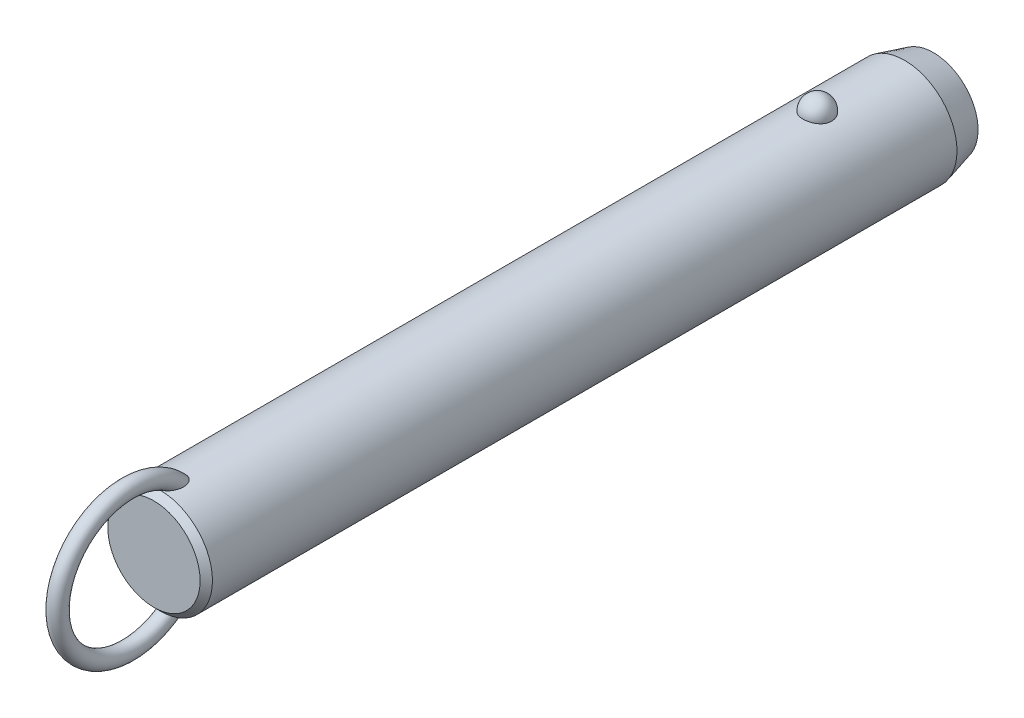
ISO-10303-21;
HEADER;
FILE_DESCRIPTION(('STEP AP214'),'2;1');
FILE_NAME('part.step','',(''),(''),'','','');
FILE_SCHEMA(('AUTOMOTIVE_DESIGN { 1 0 10303 214 1 1 1 1 }'));
ENDSEC;
DATA;
#1=APPLICATION_CONTEXT('core data for automotive mechanical design processes');
#2=APPLICATION_PROTOCOL_DEFINITION('international standard','automotive_design',2000,#1);
#3=PRODUCT_CONTEXT('',#1,'mechanical');
#4=PRODUCT('Part','Part','',(#3));
#5=PRODUCT_RELATED_PRODUCT_CATEGORY('part','',(#4));
#6=PRODUCT_DEFINITION_FORMATION('','',#4);
#7=PRODUCT_DEFINITION_CONTEXT('part definition',#1,'design');
#8=PRODUCT_DEFINITION('design','',#6,#7);
#9=PRODUCT_DEFINITION_SHAPE('','',#8);
#10=(LENGTH_UNIT() NAMED_UNIT(*) SI_UNIT(.MILLI.,.METRE.));
#11=(NAMED_UNIT(*) PLANE_ANGLE_UNIT() SI_UNIT($,.RADIAN.));
#12=(NAMED_UNIT(*) SI_UNIT($,.STERADIAN.) SOLID_ANGLE_UNIT());
#13=UNCERTAINTY_MEASURE_WITH_UNIT(LENGTH_MEASURE(1.E-05),#10,'distance_accuracy_value','');
#14=(GEOMETRIC_REPRESENTATION_CONTEXT(3) GLOBAL_UNCERTAINTY_ASSIGNED_CONTEXT((#13)) GLOBAL_UNIT_ASSIGNED_CONTEXT((#10,
#11,#12)) REPRESENTATION_CONTEXT('',''));
#15=CARTESIAN_POINT('',(0.,0.,0.));
#16=DIRECTION('',(0.,0.,1.));
#17=DIRECTION('',(1.,0.,0.));
#18=AXIS2_PLACEMENT_3D('',#15,#16,#17);
#19=CARTESIAN_POINT('',(0.,0.,144.8));
#20=DIRECTION('',(0.,0.,-1.));
#21=DIRECTION('',(-1.,0.,0.));
#22=AXIS2_PLACEMENT_3D('',#19,#20,#21);
#23=CYLINDRICAL_SURFACE('',#22,12.7);
#24=CARTESIAN_POINT('',(3.46661256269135,12.2177165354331,-3.5));
#25=CARTESIAN_POINT('',(3.4666090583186,12.2177194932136,-3.30432790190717));
#26=CARTESIAN_POINT('',(3.45063567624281,12.2222841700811,-3.10861112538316));
#27=CARTESIAN_POINT('',(3.38712451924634,12.2400345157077,-2.72271899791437));
#28=CARTESIAN_POINT('',(3.33957415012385,12.2532236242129,-2.53254588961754));
#29=CARTESIAN_POINT('',(3.2141234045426,12.286724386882,-2.16324948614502));
#30=CARTESIAN_POINT('',(3.13623639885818,12.3070329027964,-1.98412136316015));
#31=CARTESIAN_POINT('',(2.95205930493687,12.3525018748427,-1.64180592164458));
#32=CARTESIAN_POINT('',(2.84577003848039,12.3776621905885,-1.47861814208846));
#33=CARTESIAN_POINT('',(2.60688050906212,12.4301712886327,-1.17190583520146));
#34=CARTESIAN_POINT('',(2.47415697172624,12.4575299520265,-1.02847897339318));
#35=CARTESIAN_POINT('',(2.18615174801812,12.5112810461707,-0.766177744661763));
#36=CARTESIAN_POINT('',(2.03087002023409,12.5376734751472,-0.64730342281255));
#37=CARTESIAN_POINT('',(1.70237334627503,12.5864761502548,-0.437732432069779));
#38=CARTESIAN_POINT('',(1.52920948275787,12.6088972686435,-0.346958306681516));
#39=CARTESIAN_POINT('',(1.16944170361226,12.6473352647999,-0.195750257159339));
#40=CARTESIAN_POINT('',(0.982839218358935,12.663352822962,-0.135313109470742));
#41=CARTESIAN_POINT('',(0.604961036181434,12.6869706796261,-0.0473241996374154));
#42=CARTESIAN_POINT('',(0.413823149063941,12.6947125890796,-0.0192185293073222));
#43=CARTESIAN_POINT('',(0.0293827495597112,12.7014203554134,0.00517254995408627));
#44=CARTESIAN_POINT('',(-0.163919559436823,12.7003870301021,0.00146092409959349));
#45=CARTESIAN_POINT('',(-0.544374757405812,12.689735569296,-0.0373939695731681));
#46=CARTESIAN_POINT('',(-0.731575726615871,12.6802364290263,-0.0721015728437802));
#47=CARTESIAN_POINT('',(-1.09733277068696,12.6538333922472,-0.171364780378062));
#48=CARTESIAN_POINT('',(-1.27588869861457,12.6369293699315,-0.235920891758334));
#49=CARTESIAN_POINT('',(-1.6204698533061,12.5973946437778,-0.393548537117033));
#50=CARTESIAN_POINT('',(-1.78641865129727,12.5747321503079,-0.486778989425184));
#51=CARTESIAN_POINT('',(-2.10030671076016,12.5261316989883,-0.699110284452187));
#52=CARTESIAN_POINT('',(-2.24824419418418,12.5001934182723,-0.818213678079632));
#53=CARTESIAN_POINT('',(-2.52491489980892,12.4472906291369,-1.08157124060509));
#54=CARTESIAN_POINT('',(-2.65324222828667,12.4203160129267,-1.22624992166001));
#55=CARTESIAN_POINT('',(-2.88410007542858,12.3687509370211,-1.53528325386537));
#56=CARTESIAN_POINT('',(-2.98662883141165,12.3441606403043,-1.69963924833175));
#57=CARTESIAN_POINT('',(-3.16432417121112,12.2998199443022,-2.04548497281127));
#58=CARTESIAN_POINT('',(-3.23917525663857,12.2801261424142,-2.22714424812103));
#59=CARTESIAN_POINT('',(-3.35800573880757,12.248167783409,-2.6009138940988));
#60=CARTESIAN_POINT('',(-3.4019860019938,12.2359030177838,-2.79302397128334));
#61=CARTESIAN_POINT('',(-3.45784812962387,12.2202347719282,-3.18140279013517));
#62=CARTESIAN_POINT('',(-3.46986123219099,12.2167950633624,-3.37765118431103));
#63=CARTESIAN_POINT('',(-3.46186273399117,12.2190638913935,-3.76943689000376));
#64=CARTESIAN_POINT('',(-3.44185196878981,12.2247721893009,-3.96497421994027));
#65=CARTESIAN_POINT('',(-3.37048652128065,12.2446381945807,-4.34881728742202));
#66=CARTESIAN_POINT('',(-3.31928253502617,12.2587552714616,-4.53715319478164));
#67=CARTESIAN_POINT('',(-3.18693461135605,12.2938237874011,-4.90231727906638));
#68=CARTESIAN_POINT('',(-3.1057895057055,12.3147754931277,-5.07914500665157));
#69=CARTESIAN_POINT('',(-2.91506431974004,12.3613125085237,-5.41732059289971));
#70=CARTESIAN_POINT('',(-2.80533587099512,12.3869217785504,-5.57858147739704));
#71=CARTESIAN_POINT('',(-2.560414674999,12.4398525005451,-5.88013283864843));
#72=CARTESIAN_POINT('',(-2.42522099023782,12.4671740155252,-6.02042254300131));
#73=CARTESIAN_POINT('',(-2.1323357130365,12.5205965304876,-6.27662798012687));
#74=CARTESIAN_POINT('',(-1.97456596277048,12.5466928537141,-6.3924554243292));
#75=CARTESIAN_POINT('',(-1.64115839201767,12.5946384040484,-6.59583547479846));
#76=CARTESIAN_POINT('',(-1.46552179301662,12.6164879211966,-6.68339001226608));
#77=CARTESIAN_POINT('',(-1.10356050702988,12.6532533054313,-6.82682153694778));
#78=CARTESIAN_POINT('',(-0.917391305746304,12.6682500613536,-6.8830698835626));
#79=CARTESIAN_POINT('',(-0.537836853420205,12.6900288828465,-6.96386887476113));
#80=CARTESIAN_POINT('',(-0.344452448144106,12.6968119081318,-6.9884232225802));
#81=CARTESIAN_POINT('',(0.0402577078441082,12.7013667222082,-7.00496469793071));
#82=CARTESIAN_POINT('',(0.231556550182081,12.6993008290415,-6.99753844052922));
#83=CARTESIAN_POINT('',(0.610105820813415,12.6867505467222,-6.9516636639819));
#84=CARTESIAN_POINT('',(0.797356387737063,12.6762664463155,-6.913216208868));
#85=CARTESIAN_POINT('',(1.16186657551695,12.6480587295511,-6.80658431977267));
#86=CARTESIAN_POINT('',(1.33915951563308,12.6303611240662,-6.73850666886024));
#87=CARTESIAN_POINT('',(1.67968518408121,12.5896027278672,-6.5745087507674));
#88=CARTESIAN_POINT('',(1.84291705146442,12.5665416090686,-6.47858678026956));
#89=CARTESIAN_POINT('',(2.15340192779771,12.5171072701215,-6.25982455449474));
#90=CARTESIAN_POINT('',(2.30037831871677,12.4906895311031,-6.13660186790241));
#91=CARTESIAN_POINT('',(2.5717412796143,12.4376567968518,-5.86739587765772));
#92=CARTESIAN_POINT('',(2.69612388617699,12.4110417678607,-5.72140858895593));
#93=CARTESIAN_POINT('',(2.92107785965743,12.360051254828,-5.40794137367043));
#94=CARTESIAN_POINT('',(3.02121329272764,12.3357209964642,-5.24014110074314));
#95=CARTESIAN_POINT('',(3.19236291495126,12.2925446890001,-4.8896986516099));
#96=CARTESIAN_POINT('',(3.26338839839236,12.2736965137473,-4.70706226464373));
#97=CARTESIAN_POINT('',(3.36788038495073,12.245404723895,-4.35469510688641));
#98=CARTESIAN_POINT('',(3.40484026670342,12.2351018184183,-4.18605935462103));
#99=CARTESIAN_POINT('',(3.45420764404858,12.2212564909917,-3.84496058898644));
#100=CARTESIAN_POINT('',(3.46661565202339,12.2177139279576,-3.67249765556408));
#101=CARTESIAN_POINT('',(3.46661256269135,12.2177165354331,-3.5));
#102=B_SPLINE_CURVE_WITH_KNOTS('',3,(#24,#25,#26,#27,#28,#29,#30,#31,#32,#33,#34,#35,#36,#37,
#38,#39,#40,#41,#42,#43,#44,#45,#46,#47,#48,#49,#50,#51,#52,#53,#54,#55,#56,#57,#58,#59,#60,#61,
#62,#63,#64,#65,#66,#67,#68,#69,#70,#71,#72,#73,#74,#75,#76,#77,#78,#79,#80,#81,#82,#83,#84,#85,
#86,#87,#88,#89,#90,#91,#92,#93,#94,#95,#96,#97,#98,#99,#100,#101),.UNSPECIFIED.,.T.,.F.,(4,2,2,
2,2,2,2,2,2,2,2,2,2,2,2,2,2,2,2,2,2,2,2,2,2,2,2,2,2,2,2,2,2,2,2,2,2,2,4),(0.,0.586396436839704,
1.17302689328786,1.7593990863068,2.34575431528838,2.93491084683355,3.52406845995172,
4.11158733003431,4.69904375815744,5.2762784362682,5.85345931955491,6.42265312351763,
6.99185659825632,7.56427334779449,8.136746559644,8.71981013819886,9.3029135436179,
9.89247258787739,10.4820150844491,11.0691335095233,11.6562366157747,12.2405256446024,
12.8248374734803,13.412244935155,13.9996740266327,14.5891883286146,15.1786623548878,
15.7609861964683,16.3432419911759,16.914863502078,17.4864654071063,18.056024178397,
18.6256177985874,19.2037609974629,19.7820055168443,20.3699810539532,20.9577282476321,
21.4746855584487,21.9916320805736),.UNSPECIFIED.);
#103=CARTESIAN_POINT('',(3.46661256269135,12.2177165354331,-3.5));
#104=VERTEX_POINT('',#103);
#105=EDGE_CURVE('E41',#104,#104,#102,.T.);
#106=ORIENTED_EDGE('',*,*,#105,.T.);
#107=EDGE_LOOP('',(#106));
#108=FACE_BOUND('',#107,.T.);
#109=CARTESIAN_POINT('',(0.,0.,156.));
#110=DIRECTION('',(0.,0.,1.));
#111=DIRECTION('',(1.,0.,0.));
#112=AXIS2_PLACEMENT_3D('',#109,#110,#111);
#113=CIRCLE('',#112,12.7);
#114=CARTESIAN_POINT('',(12.7,0.,156.));
#115=VERTEX_POINT('',#114);
#116=EDGE_CURVE('E10',#115,#115,#113,.F.);
#117=ORIENTED_EDGE('',*,*,#116,.T.);
#118=EDGE_LOOP('',(#117));
#119=FACE_BOUND('',#118,.T.);
#120=CARTESIAN_POINT('',(-0.548122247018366,-12.6881662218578,149.743218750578));
#121=CARTESIAN_POINT('',(-0.648865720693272,-12.6838128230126,149.777926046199));
#122=CARTESIAN_POINT('',(-0.746398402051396,-12.6783867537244,149.822042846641));
#123=CARTESIAN_POINT('',(-0.932125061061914,-12.666091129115,149.926764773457));
#124=CARTESIAN_POINT('',(-1.02030388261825,-12.6592192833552,149.987396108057));
#125=CARTESIAN_POINT('',(-1.18487740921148,-12.6448747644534,150.121847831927));
#126=CARTESIAN_POINT('',(-1.26134296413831,-12.637406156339,150.195582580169));
#127=CARTESIAN_POINT('',(-1.4023120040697,-12.6225412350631,150.353604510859));
#128=CARTESIAN_POINT('',(-1.466814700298,-12.6151449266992,150.43789238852));
#129=CARTESIAN_POINT('',(-1.60714786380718,-12.5981718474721,150.649657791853));
#130=CARTESIAN_POINT('',(-1.67725126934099,-12.588900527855,150.780962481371));
#131=CARTESIAN_POINT('',(-1.79536591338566,-12.5725964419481,151.053247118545));
#132=CARTESIAN_POINT('',(-1.84333535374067,-12.5655679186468,151.194244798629));
#133=CARTESIAN_POINT('',(-1.93422576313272,-12.5519624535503,151.537645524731));
#134=CARTESIAN_POINT('',(-1.96788773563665,-12.5466298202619,151.742557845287));
#135=CARTESIAN_POINT('',(-1.9941399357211,-12.542463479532,152.051760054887));
#136=CARTESIAN_POINT('',(-1.99883864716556,-12.5417153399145,152.155298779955));
#137=CARTESIAN_POINT('',(-2.00078003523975,-12.5414074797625,152.36245124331));
#138=CARTESIAN_POINT('',(-1.99802449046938,-12.5418474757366,152.466064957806));
#139=CARTESIAN_POINT('',(-1.98336733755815,-12.5441750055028,152.71032076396));
#140=CARTESIAN_POINT('',(-1.96851430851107,-12.5465291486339,152.850780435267));
#141=CARTESIAN_POINT('',(-1.92707089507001,-12.5529612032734,153.129960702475));
#142=CARTESIAN_POINT('',(-1.900474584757,-12.5570399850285,153.268680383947));
#143=CARTESIAN_POINT('',(-1.83619120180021,-12.5666008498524,153.54341135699));
#144=CARTESIAN_POINT('',(-1.79850828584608,-12.57208240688,153.679423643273));
#145=CARTESIAN_POINT('',(-1.71223796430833,-12.5841228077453,153.947842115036));
#146=CARTESIAN_POINT('',(-1.66365679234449,-12.5906810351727,154.080250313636));
#147=CARTESIAN_POINT('',(-1.57804503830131,-12.6016176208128,154.28548877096));
#148=CARTESIAN_POINT('',(-1.54477252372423,-12.6057501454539,154.359914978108));
#149=CARTESIAN_POINT('',(-1.47424480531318,-12.6141930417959,154.506839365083));
#150=CARTESIAN_POINT('',(-1.43699041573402,-12.6185033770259,154.579337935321));
#151=CARTESIAN_POINT('',(-1.35825795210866,-12.6272207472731,154.721892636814));
#152=CARTESIAN_POINT('',(-1.31678520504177,-12.6316276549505,154.791951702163));
#153=CARTESIAN_POINT('',(-1.22917793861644,-12.6404532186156,154.929070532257));
#154=CARTESIAN_POINT('',(-1.18304514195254,-12.6448718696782,154.996131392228));
#155=CARTESIAN_POINT('',(-1.07246411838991,-12.6547893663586,155.143874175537));
#156=CARTESIAN_POINT('',(-1.0064223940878,-12.6602600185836,155.223384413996));
#157=CARTESIAN_POINT('',(-0.864441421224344,-12.6707460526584,155.373169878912));
#158=CARTESIAN_POINT('',(-0.788516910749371,-12.6757620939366,155.443458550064));
#159=CARTESIAN_POINT('',(-0.652215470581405,-12.6833591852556,155.548680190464));
#160=CARTESIAN_POINT('',(-0.594982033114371,-12.6861973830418,155.587624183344));
#161=CARTESIAN_POINT('',(-0.475269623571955,-12.6912445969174,155.656489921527));
#162=CARTESIAN_POINT('',(-0.412800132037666,-12.6934547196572,155.686427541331));
#163=CARTESIAN_POINT('',(-0.295749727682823,-12.6966636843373,155.729756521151));
#164=CARTESIAN_POINT('',(-0.2419499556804,-12.6978134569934,155.745218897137));
#165=CARTESIAN_POINT('',(-0.132508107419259,-12.6994261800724,155.766884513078));
#166=CARTESIAN_POINT('',(-0.0768679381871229,-12.6998898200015,155.773097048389));
#167=CARTESIAN_POINT('',(0.0347696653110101,-12.7000752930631,155.775583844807));
#168=CARTESIAN_POINT('',(0.0907676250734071,-12.6997954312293,155.771835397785));
#169=CARTESIAN_POINT('',(0.20128301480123,-12.6985255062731,155.754788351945));
#170=CARTESIAN_POINT('',(0.255799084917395,-12.6975348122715,155.741481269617));
#171=CARTESIAN_POINT('',(0.376042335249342,-12.6946091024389,155.70203792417));
#172=CARTESIAN_POINT('',(0.440950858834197,-12.6924943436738,155.673449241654));
#173=CARTESIAN_POINT('',(0.56535027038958,-12.6875639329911,155.606323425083));
#174=CARTESIAN_POINT('',(0.624828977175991,-12.6847467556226,155.567764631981));
#175=CARTESIAN_POINT('',(0.774116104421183,-12.6767252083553,155.456949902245));
#176=CARTESIAN_POINT('',(0.859449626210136,-12.6711344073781,155.378760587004));
#177=CARTESIAN_POINT('',(1.01789440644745,-12.6593922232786,155.210943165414));
#178=CARTESIAN_POINT('',(1.09096902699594,-12.653239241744,155.121282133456));
#179=CARTESIAN_POINT('',(1.22268793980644,-12.6411674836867,154.940265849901));
#180=CARTESIAN_POINT('',(1.28193986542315,-12.6352572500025,154.849345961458));
#181=CARTESIAN_POINT('',(1.39259777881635,-12.6235401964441,154.662792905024));
#182=CARTESIAN_POINT('',(1.44399707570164,-12.6177334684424,154.567155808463));
#183=CARTESIAN_POINT('',(1.53972870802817,-12.6064093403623,154.372273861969));
#184=CARTESIAN_POINT('',(1.58405262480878,-12.6008922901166,154.273024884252));
#185=CARTESIAN_POINT('',(1.66600705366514,-12.5903187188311,154.071772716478));
#186=CARTESIAN_POINT('',(1.70363651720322,-12.5852622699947,153.969769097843));
#187=CARTESIAN_POINT('',(1.77545379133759,-12.5753406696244,153.754358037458));
#188=CARTESIAN_POINT('',(1.80903453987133,-12.5705328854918,153.640745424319));
#189=CARTESIAN_POINT('',(1.86844163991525,-12.5618400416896,153.411457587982));
#190=CARTESIAN_POINT('',(1.89426665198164,-12.5579551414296,153.295782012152));
#191=CARTESIAN_POINT('',(1.93785464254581,-12.5513030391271,153.063007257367));
#192=CARTESIAN_POINT('',(1.95562640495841,-12.5485346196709,152.945909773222));
#193=CARTESIAN_POINT('',(1.98264463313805,-12.5442934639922,152.710747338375));
#194=CARTESIAN_POINT('',(1.99189298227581,-12.5428204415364,152.59268260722));
#195=CARTESIAN_POINT('',(2.00416068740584,-12.540871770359,152.280622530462));
#196=CARTESIAN_POINT('',(1.99944433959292,-12.541631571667,152.086229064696));
#197=CARTESIAN_POINT('',(1.9611375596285,-12.5476846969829,151.700309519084));
#198=CARTESIAN_POINT('',(1.92758341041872,-12.5529723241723,151.508780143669));
#199=CARTESIAN_POINT('',(1.83934342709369,-12.5661532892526,151.182272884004));
#200=CARTESIAN_POINT('',(1.79215440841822,-12.5730485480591,151.04524997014));
#201=CARTESIAN_POINT('',(1.67676242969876,-12.588958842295,150.780445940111));
#202=CARTESIAN_POINT('',(1.60859050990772,-12.597970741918,150.652651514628));
#203=CARTESIAN_POINT('',(1.46583832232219,-12.6152829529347,150.435800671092));
#204=CARTESIAN_POINT('',(1.39525727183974,-12.6233659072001,150.34410500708));
#205=CARTESIAN_POINT('',(1.23992594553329,-12.6395676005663,150.173485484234));
#206=CARTESIAN_POINT('',(1.15517932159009,-12.6476863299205,150.094558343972));
#207=CARTESIAN_POINT('',(0.971995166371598,-12.6630846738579,149.952643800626));
#208=CARTESIAN_POINT('',(0.873456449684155,-12.6703572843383,149.889784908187));
#209=CARTESIAN_POINT('',(0.665847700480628,-12.6829569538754,149.784487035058));
#210=CARTESIAN_POINT('',(0.556784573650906,-12.688285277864,149.742034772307));
#211=CARTESIAN_POINT('',(0.347338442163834,-12.6956226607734,149.684443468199));
#212=CARTESIAN_POINT('',(0.247759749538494,-12.6979816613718,149.666399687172));
#213=CARTESIAN_POINT('',(0.0470218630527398,-12.7003077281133,149.648600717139));
#214=CARTESIAN_POINT('',(-0.0541350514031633,-12.7002779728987,149.648821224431));
#215=CARTESIAN_POINT('',(-0.221414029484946,-12.6982482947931,149.664363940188));
#216=CARTESIAN_POINT('',(-0.288055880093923,-12.6969033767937,149.674666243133));
#217=CARTESIAN_POINT('',(-0.419599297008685,-12.6932369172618,149.70313489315));
#218=CARTESIAN_POINT('',(-0.484501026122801,-12.6909154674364,149.721300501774));
#219=CARTESIAN_POINT('',(-0.548122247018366,-12.6881662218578,149.743218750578));
#220=B_SPLINE_CURVE_WITH_KNOTS('',3,(#120,#121,#122,#123,#124,#125,#126,#127,#128,#129,#130,
#131,#132,#133,#134,#135,#136,#137,#138,#139,#140,#141,#142,#143,#144,#145,#146,#147,#148,#149,
#150,#151,#152,#153,#154,#155,#156,#157,#158,#159,#160,#161,#162,#163,#164,#165,#166,#167,#168,
#169,#170,#171,#172,#173,#174,#175,#176,#177,#178,#179,#180,#181,#182,#183,#184,#185,#186,#187,
#188,#189,#190,#191,#192,#193,#194,#195,#196,#197,#198,#199,#200,#201,#202,#203,#204,#205,#206,
#207,#208,#209,#210,#211,#212,#213,#214,#215,#216,#217,#218,#219),.UNSPECIFIED.,.T.,.F.,(4,2,2,
2,2,2,2,2,2,2,2,2,2,2,2,2,2,2,2,2,2,2,2,2,2,2,2,2,2,2,2,2,2,2,2,2,2,2,2,2,2,2,2,2,2,2,2,2,2,4),
(0.,0.31964225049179,0.639794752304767,0.957927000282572,1.27608021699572,1.72100165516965,
2.16675988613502,2.78630021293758,3.09705782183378,3.40774128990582,3.8309635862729,
4.25439969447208,4.67767724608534,5.1007133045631,5.34550297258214,5.59024267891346,
5.83467707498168,6.07902143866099,6.38891080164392,6.69834321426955,6.90560910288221,
7.11250749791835,7.27977315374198,7.44687060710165,7.6143493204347,7.78197685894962,
7.99365544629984,8.20579780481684,8.55147335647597,8.89816429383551,9.22375138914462,
9.54961437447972,9.87586224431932,10.202161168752,10.557587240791,10.9130746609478,
11.2681734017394,11.6231936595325,12.2046601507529,12.7853961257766,13.219164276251,
13.6522938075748,13.9989174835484,14.3454519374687,14.6946768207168,15.0436740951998,
15.3457513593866,15.6474266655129,15.8493051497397,16.0511646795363),.UNSPECIFIED.);
#221=CARTESIAN_POINT('',(-0.548122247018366,-12.6881662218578,149.743218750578));
#222=VERTEX_POINT('',#221);
#223=EDGE_CURVE('E59',#222,#222,#220,.T.);
#224=ORIENTED_EDGE('',*,*,#223,.T.);
#225=EDGE_LOOP('',(#224));
#226=FACE_BOUND('',#225,.T.);
#227=CARTESIAN_POINT('',(-0.548122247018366,12.6881662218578,149.743218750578));
#228=CARTESIAN_POINT('',(-0.459436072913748,12.6919968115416,149.712673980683));
#229=CARTESIAN_POINT('',(-0.368189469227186,12.6949996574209,149.689391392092));
#230=CARTESIAN_POINT('',(-0.183024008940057,12.6990186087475,149.658406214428));
#231=CARTESIAN_POINT('',(-0.0891049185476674,12.7000345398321,149.650704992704));
#232=CARTESIAN_POINT('',(0.0987147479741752,12.6999636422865,149.651245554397));
#233=CARTESIAN_POINT('',(0.192615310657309,12.6988761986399,149.659492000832));
#234=CARTESIAN_POINT('',(0.377658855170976,12.6947211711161,149.691551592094));
#235=CARTESIAN_POINT('',(0.468801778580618,12.6916535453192,149.715365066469));
#236=CARTESIAN_POINT('',(0.645809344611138,12.6838788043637,149.77745651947));
#237=CARTESIAN_POINT('',(0.731679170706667,12.6791733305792,149.815720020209));
#238=CARTESIAN_POINT('',(0.896315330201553,12.6686004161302,149.905120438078));
#239=CARTESIAN_POINT('',(0.975080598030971,12.6627328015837,149.956259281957));
#240=CARTESIAN_POINT('',(1.12963655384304,12.6499161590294,150.07367820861));
#241=CARTESIAN_POINT('',(1.20478673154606,12.6429194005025,150.140792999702));
#242=CARTESIAN_POINT('',(1.34448241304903,12.6288282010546,150.28522507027));
#243=CARTESIAN_POINT('',(1.40902173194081,12.621733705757,150.362548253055));
#244=CARTESIAN_POINT('',(1.55208211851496,12.6050877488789,150.559247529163));
#245=CARTESIAN_POINT('',(1.62510490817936,12.5957546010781,150.682654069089));
#246=CARTESIAN_POINT('',(1.75019044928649,12.5789823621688,150.939769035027));
#247=CARTESIAN_POINT('',(1.8022137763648,12.5715468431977,151.073496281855));
#248=CARTESIAN_POINT('',(1.90309965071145,12.5567434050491,151.398351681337));
#249=CARTESIAN_POINT('',(1.94342317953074,12.5504515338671,151.592161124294));
#250=CARTESIAN_POINT('',(1.99332997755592,12.5426147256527,151.98378810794));
#251=CARTESIAN_POINT('',(2.00285305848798,12.5410790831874,152.181612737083));
#252=CARTESIAN_POINT('',(1.99678999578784,12.5420407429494,152.516642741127));
#253=CARTESIAN_POINT('',(1.98794117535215,12.5434564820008,152.654042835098));
#254=CARTESIAN_POINT('',(1.95865119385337,12.5480641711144,152.927639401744));
#255=CARTESIAN_POINT('',(1.93820436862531,12.5512569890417,153.063835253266));
#256=CARTESIAN_POINT('',(1.88647896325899,12.5591352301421,153.334249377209));
#257=CARTESIAN_POINT('',(1.85518800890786,12.5638223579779,153.468465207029));
#258=CARTESIAN_POINT('',(1.78217886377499,12.5743868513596,153.733936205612));
#259=CARTESIAN_POINT('',(1.74046509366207,12.5802637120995,153.865192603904));
#260=CARTESIAN_POINT('',(1.66024095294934,12.5910571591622,154.086085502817));
#261=CARTESIAN_POINT('',(1.62434772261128,12.5957535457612,154.176690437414));
#262=CARTESIAN_POINT('',(1.54709009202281,12.6054762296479,154.355512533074));
#263=CARTESIAN_POINT('',(1.50572681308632,12.6105024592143,154.443730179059));
#264=CARTESIAN_POINT('',(1.41728020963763,12.620748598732,154.616932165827));
#265=CARTESIAN_POINT('',(1.37021377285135,12.625967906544,154.701925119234));
#266=CARTESIAN_POINT('',(1.26969620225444,12.6364721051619,154.868007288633));
#267=CARTESIAN_POINT('',(1.21624929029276,12.6417569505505,154.949099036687));
#268=CARTESIAN_POINT('',(1.1030441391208,12.6521331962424,155.104702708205));
#269=CARTESIAN_POINT('',(1.04340936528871,12.657226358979,155.179303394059));
#270=CARTESIAN_POINT('',(0.915919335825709,12.667090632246,155.321324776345));
#271=CARTESIAN_POINT('',(0.848064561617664,12.6718617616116,155.38874589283));
#272=CARTESIAN_POINT('',(0.717035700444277,12.67987711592,155.500624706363));
#273=CARTESIAN_POINT('',(0.655526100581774,12.6832377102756,155.546997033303));
#274=CARTESIAN_POINT('',(0.525985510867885,12.6892676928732,155.629619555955));
#275=CARTESIAN_POINT('',(0.457969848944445,12.6919386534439,155.665892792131));
#276=CARTESIAN_POINT('',(0.334859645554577,12.695691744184,155.716657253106));
#277=CARTESIAN_POINT('',(0.281116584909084,12.6970073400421,155.734373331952));
#278=CARTESIAN_POINT('',(0.171425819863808,12.6989609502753,155.760642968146));
#279=CARTESIAN_POINT('',(0.115480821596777,12.699599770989,155.769207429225));
#280=CARTESIAN_POINT('',(0.00272618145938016,12.7001251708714,155.776253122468));
#281=CARTESIAN_POINT('',(-0.0540859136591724,12.7000089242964,155.774696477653));
#282=CARTESIAN_POINT('',(-0.16654462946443,12.6990328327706,155.761600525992));
#283=CARTESIAN_POINT('',(-0.222190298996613,12.6981724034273,155.750053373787));
#284=CARTESIAN_POINT('',(-0.342018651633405,12.695562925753,155.714912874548));
#285=CARTESIAN_POINT('',(-0.405606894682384,12.6936676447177,155.68933225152));
#286=CARTESIAN_POINT('',(-0.527815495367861,12.6891754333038,155.628311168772));
#287=CARTESIAN_POINT('',(-0.586425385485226,12.6865770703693,155.592850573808));
#288=CARTESIAN_POINT('',(-0.731842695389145,12.6792129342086,155.491496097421));
#289=CARTESIAN_POINT('',(-0.814709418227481,12.6740767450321,155.4200395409));
#290=CARTESIAN_POINT('',(-0.969101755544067,12.6632083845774,155.26589007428));
#291=CARTESIAN_POINT('',(-1.04059564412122,12.6574746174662,155.183166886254));
#292=CARTESIAN_POINT('',(-1.16981116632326,12.6461638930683,155.015809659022));
#293=CARTESIAN_POINT('',(-1.22811369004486,12.6405994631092,154.931616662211));
#294=CARTESIAN_POINT('',(-1.33743405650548,12.6295007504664,154.758579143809));
#295=CARTESIAN_POINT('',(-1.38844577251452,12.6239664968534,154.669730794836));
#296=CARTESIAN_POINT('',(-1.48400702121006,12.6130898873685,154.488389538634));
#297=CARTESIAN_POINT('',(-1.52854232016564,12.6077479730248,154.395889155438));
#298=CARTESIAN_POINT('',(-1.61150113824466,12.5974127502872,154.208160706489));
#299=CARTESIAN_POINT('',(-1.64992317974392,12.5924195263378,154.112931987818));
#300=CARTESIAN_POINT('',(-1.73468589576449,12.581070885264,153.88289362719));
#301=CARTESIAN_POINT('',(-1.77831261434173,12.5749388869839,153.747066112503));
#302=CARTESIAN_POINT('',(-1.85439734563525,12.5639437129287,153.472212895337));
#303=CARTESIAN_POINT('',(-1.88684994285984,12.5590811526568,153.333185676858));
#304=CARTESIAN_POINT('',(-1.94008483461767,12.550968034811,153.05309235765));
#305=CARTESIAN_POINT('',(-1.96088706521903,12.5477147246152,152.912030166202));
#306=CARTESIAN_POINT('',(-1.99000539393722,12.5431291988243,152.628668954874));
#307=CARTESIAN_POINT('',(-1.99832911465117,12.5417958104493,152.486370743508));
#308=CARTESIAN_POINT('',(-2.00166624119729,12.5412674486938,152.157627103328));
#309=CARTESIAN_POINT('',(-1.99178843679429,12.5428579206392,151.971088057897));
#310=CARTESIAN_POINT('',(-1.94455183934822,12.5502731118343,151.60162404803));
#311=CARTESIAN_POINT('',(-1.90724032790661,12.5560905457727,151.418693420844));
#312=CARTESIAN_POINT('',(-1.81330718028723,12.5699462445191,151.104848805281));
#313=CARTESIAN_POINT('',(-1.76338820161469,12.5771273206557,150.971910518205));
#314=CARTESIAN_POINT('',(-1.64305018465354,12.593414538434,150.715681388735));
#315=CARTESIAN_POINT('',(-1.57265346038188,12.6025185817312,150.592380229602));
#316=CARTESIAN_POINT('',(-1.42634956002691,12.6198178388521,150.383564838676));
#317=CARTESIAN_POINT('',(-1.35423772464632,12.6278405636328,150.295384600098));
#318=CARTESIAN_POINT('',(-1.19645664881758,12.6437632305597,150.132107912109));
#319=CARTESIAN_POINT('',(-1.1108053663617,12.6516633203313,150.056994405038));
#320=CARTESIAN_POINT('',(-0.947219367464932,12.6648319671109,149.937811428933));
#321=CARTESIAN_POINT('',(-0.871624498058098,12.670300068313,149.890541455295));
#322=CARTESIAN_POINT('',(-0.714161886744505,12.6801492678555,149.8077413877));
#323=CARTESIAN_POINT('',(-0.632295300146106,12.684530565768,149.77220913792));
#324=CARTESIAN_POINT('',(-0.548122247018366,12.6881662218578,149.743218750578));
#325=B_SPLINE_CURVE_WITH_KNOTS('',3,(#227,#228,#229,#230,#231,#232,#233,#234,#235,#236,#237,
#238,#239,#240,#241,#242,#243,#244,#245,#246,#247,#248,#249,#250,#251,#252,#253,#254,#255,#256,
#257,#258,#259,#260,#261,#262,#263,#264,#265,#266,#267,#268,#269,#270,#271,#272,#273,#274,#275,
#276,#277,#278,#279,#280,#281,#282,#283,#284,#285,#286,#287,#288,#289,#290,#291,#292,#293,#294,
#295,#296,#297,#298,#299,#300,#301,#302,#303,#304,#305,#306,#307,#308,#309,#310,#311,#312,#313,
#314,#315,#316,#317,#318,#319,#320,#321,#322,#323,#324),.UNSPECIFIED.,.T.,.F.,(4,2,2,2,2,2,2,2,
2,2,2,2,2,2,2,2,2,2,2,2,2,2,2,2,2,2,2,2,2,2,2,2,2,2,2,2,2,2,2,2,2,2,2,2,2,2,2,2,4),(0.,
0.281328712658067,0.562682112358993,0.844117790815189,1.12555942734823,1.40671982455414,
1.68792232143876,1.98972294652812,2.29169886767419,2.72039860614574,3.14989948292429,
3.74084916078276,4.33295293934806,4.74554109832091,5.15833092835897,5.57159335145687,
5.98468079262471,6.27722775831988,6.56971484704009,6.86135609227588,7.15280542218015,
7.43927407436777,7.72572595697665,7.95635862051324,8.18646071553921,8.35559393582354,
8.52452541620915,8.69408946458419,8.86378678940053,9.06834348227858,9.27332014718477,
9.60010414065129,9.92778432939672,10.2350252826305,10.5425229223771,10.8506864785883,
11.15892440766,11.5867893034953,12.0148612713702,12.4421984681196,12.8692745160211,
13.4279365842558,13.9856380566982,14.4107062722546,14.835313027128,15.1765567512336,
15.517351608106,15.7844129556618,16.051425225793),.UNSPECIFIED.);
#326=CARTESIAN_POINT('',(-0.548122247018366,12.6881662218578,149.743218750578));
#327=VERTEX_POINT('',#326);
#328=EDGE_CURVE('E67',#327,#327,#325,.T.);
#329=ORIENTED_EDGE('',*,*,#328,.T.);
#330=EDGE_LOOP('',(#329));
#331=FACE_BOUND('',#330,.T.);
#332=CARTESIAN_POINT('',(0.,0.,-24.7000000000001));
#333=DIRECTION('',(0.,0.,-1.));
#334=DIRECTION('',(-1.,0.,0.));
#335=AXIS2_PLACEMENT_3D('',#332,#333,#334);
#336=CIRCLE('',#335,12.7);
#337=CARTESIAN_POINT('',(-12.7,0.,-24.7000000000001));
#338=VERTEX_POINT('',#337);
#339=EDGE_CURVE('E56',#338,#338,#336,.F.);
#340=ORIENTED_EDGE('',*,*,#339,.T.);
#341=EDGE_LOOP('',(#340));
#342=FACE_BOUND('',#341,.T.);
#343=ADVANCED_FACE('F37',(#108,#119,#226,#331,#342),#23,.T.);
#344=CARTESIAN_POINT('',(0.,0.,-31.7));
#345=DIRECTION('',(0.,0.,-1.));
#346=DIRECTION('',(-1.,0.,0.));
#347=AXIS2_PLACEMENT_3D('',#344,#345,#346);
#348=PLANE('',#347);
#349=CARTESIAN_POINT('',(0.,0.,-31.7));
#350=DIRECTION('',(0.,0.,-1.));
#351=DIRECTION('',(-1.,0.,0.));
#352=AXIS2_PLACEMENT_3D('',#349,#350,#351);
#353=CIRCLE('',#352,10.8243556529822);
#354=CARTESIAN_POINT('',(-10.8243556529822,0.,-31.7));
#355=VERTEX_POINT('',#354);
#356=EDGE_CURVE('E66',#355,#355,#353,.T.);
#357=ORIENTED_EDGE('',*,*,#356,.T.);
#358=EDGE_LOOP('',(#357));
#359=FACE_BOUND('',#358,.T.);
#360=ADVANCED_FACE('F85',(#359),#348,.T.);
#361=CARTESIAN_POINT('',(0.,0.,-31.7));
#362=DIRECTION('',(0.,0.,1.));
#363=DIRECTION('',(1.,0.,0.));
#364=AXIS2_PLACEMENT_3D('',#361,#362,#363);
#365=CONICAL_SURFACE('',#364,10.8243556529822,0.261799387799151);
#366=ORIENTED_EDGE('',*,*,#339,.F.);
#367=EDGE_LOOP('',(#366));
#368=FACE_BOUND('',#367,.T.);
#369=ORIENTED_EDGE('',*,*,#356,.F.);
#370=EDGE_LOOP('',(#369));
#371=FACE_BOUND('',#370,.T.);
#372=ADVANCED_FACE('F83',(#368,#371),#365,.T.);
#373=CARTESIAN_POINT('',(0.,0.,157.5));
#374=DIRECTION('',(0.,0.,1.));
#375=DIRECTION('',(1.,0.,0.));
#376=AXIS2_PLACEMENT_3D('',#373,#374,#375);
#377=PLANE('',#376);
#378=CARTESIAN_POINT('',(0.,0.,157.5));
#379=DIRECTION('',(0.,0.,1.));
#380=DIRECTION('',(1.,0.,0.));
#381=AXIS2_PLACEMENT_3D('',#378,#379,#380);
#382=CIRCLE('',#381,11.2000000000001);
#383=CARTESIAN_POINT('',(11.2000000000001,0.,157.5));
#384=VERTEX_POINT('',#383);
#385=EDGE_CURVE('E50',#384,#384,#382,.T.);
#386=ORIENTED_EDGE('',*,*,#385,.T.);
#387=EDGE_LOOP('',(#386));
#388=FACE_BOUND('',#387,.T.);
#389=ADVANCED_FACE('F77',(#388),#377,.T.);
#390=CARTESIAN_POINT('',(0.,0.,163.85));
#391=DIRECTION('',(1.,0.,0.));
#392=DIRECTION('',(0.,0.,-1.));
#393=AXIS2_PLACEMENT_3D('',#390,#391,#392);
#394=TOROIDAL_SURFACE('',#393,17.05,2.);
#395=ORIENTED_EDGE('',*,*,#328,.F.);
#396=EDGE_LOOP('',(#395));
#397=FACE_BOUND('',#396,.T.);
#398=ORIENTED_EDGE('',*,*,#223,.F.);
#399=EDGE_LOOP('',(#398));
#400=FACE_BOUND('',#399,.T.);
#401=ADVANCED_FACE('F73',(#397,#400),#394,.T.);
#402=CARTESIAN_POINT('',(0.,0.,157.5));
#403=DIRECTION('',(0.,0.,-1.));
#404=DIRECTION('',(-1.,0.,0.));
#405=AXIS2_PLACEMENT_3D('',#402,#403,#404);
#406=CONICAL_SURFACE('',#405,11.2000000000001,0.785398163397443);
#407=ORIENTED_EDGE('',*,*,#116,.F.);
#408=EDGE_LOOP('',(#407));
#409=FACE_BOUND('',#408,.T.);
#410=ORIENTED_EDGE('',*,*,#385,.F.);
#411=EDGE_LOOP('',(#410));
#412=FACE_BOUND('',#411,.T.);
#413=ADVANCED_FACE('F39',(#409,#412),#406,.T.);
#414=CARTESIAN_POINT('',(0.,12.7,-3.5));
#415=DIRECTION('',(0.,1.,0.));
#416=DIRECTION('',(0.,0.,-1.));
#417=AXIS2_PLACEMENT_3D('',#414,#415,#416);
#418=SPHERICAL_SURFACE('',#417,3.5);
#419=ORIENTED_EDGE('',*,*,#105,.F.);
#420=EDGE_LOOP('',(#419));
#421=FACE_BOUND('',#420,.T.);
#422=ADVANCED_FACE('F79',(#421),#418,.T.);
#423=CLOSED_SHELL('',(#343,#360,#372,#389,#401,#413,#422));
#424=MANIFOLD_SOLID_BREP('B2',#423);
#425=ADVANCED_BREP_SHAPE_REPRESENTATION('',(#18,#424),#14);
#426=SHAPE_DEFINITION_REPRESENTATION(#9,#425);
ENDSEC;
END-ISO-10303-21;
